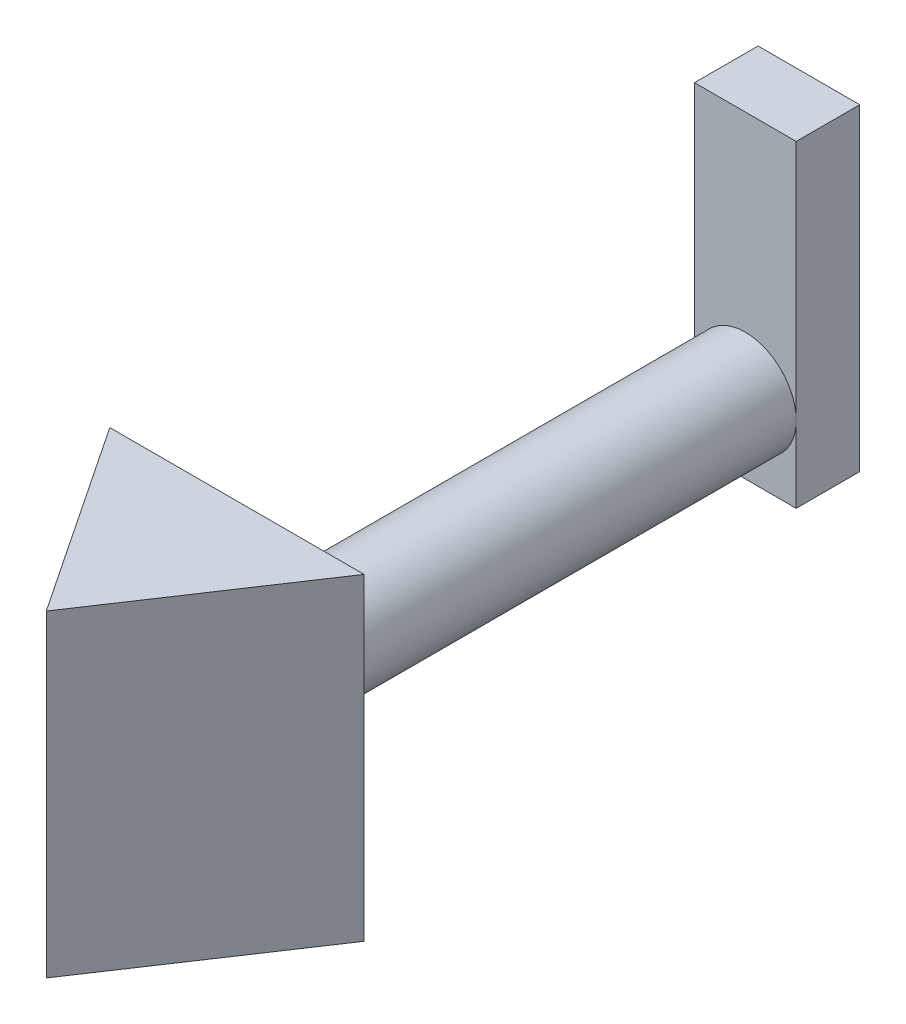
from build123d import *

# Parameters (mm, degrees)
ESQUISSE1_R        = 8
BOSS_EXTRU_1_DEPTH = 80
ESQUISSE2_W        = 16
ESQUISSE2_H        = 50
BOSS_EXTRU_2_DEPTH = 10
BOSS_EXTRU_3_DEPTH = 25


with BuildPart() as part:
    # Esquisse1 → Boss.-Extru.1 (new body)
    with BuildSketch(Plane.XY):
        Circle(ESQUISSE1_R)
    extrude(amount=BOSS_EXTRU_1_DEPTH)

    # Esquisse2 → Boss.-Extru.2 (add)
    with BuildSketch(Plane(origin=(0, 0, 0), x_dir=(-1, 0, 0), z_dir=(0, 0, -1))):
        with Locations((0, 13)):
            Rectangle(ESQUISSE2_W, ESQUISSE2_H)
    extrude(amount=BOSS_EXTRU_2_DEPTH)

    # Esquisse5 → Boss.-Extru.3 (add, symmetric)
    with BuildSketch(Plane(origin=(0, 0, 0), x_dir=(1, 0, 0), z_dir=(0, 1, 0))):
        Polygon((0, -80), (20, -80), (0, -110), (-20, -80), align=None)
    extrude(amount=BOSS_EXTRU_3_DEPTH, both=True)


solid = part.part
